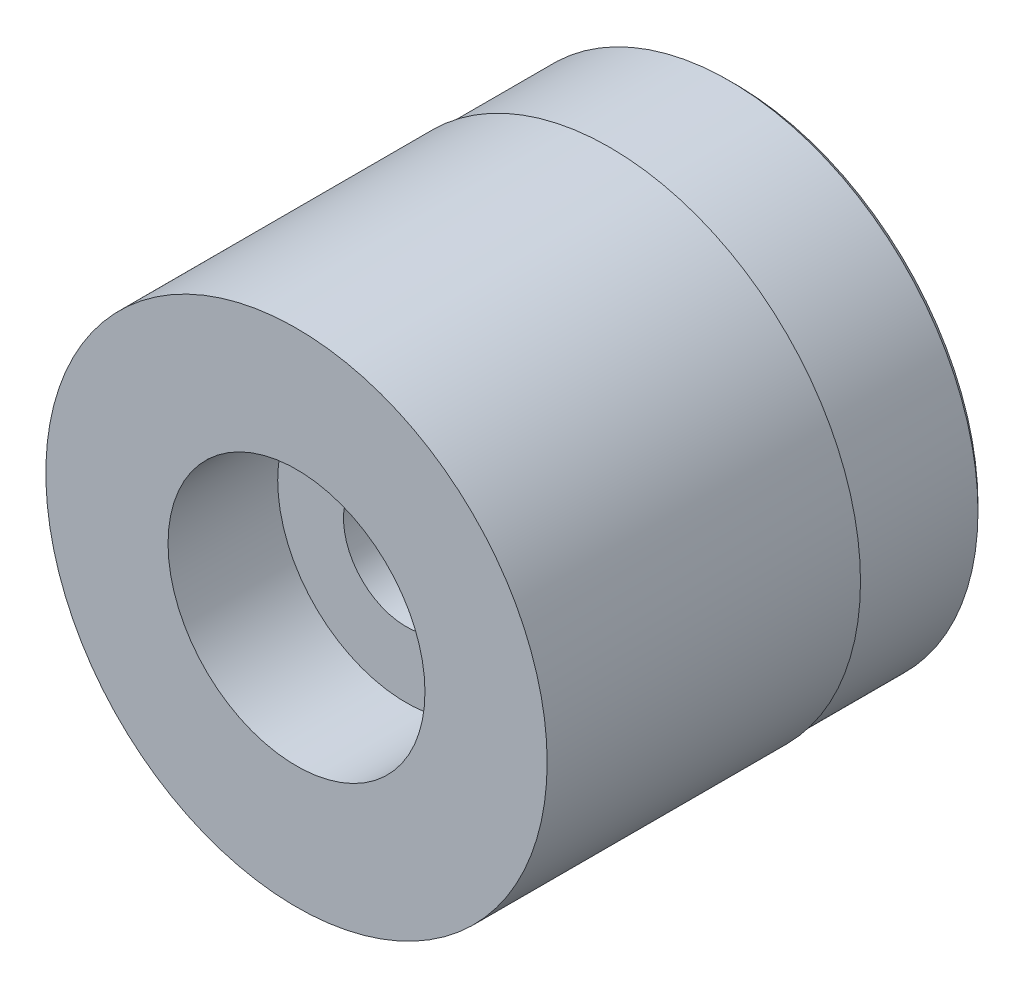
from build123d import *

# Parameters (mm, degrees)
SKETCH4_W = 4
SKETCH4_H = 1


with BuildPart() as part:
    # Sketch1 → Revolve1 (revolve)
    with BuildSketch(Plane(origin=(0, 0, 0), x_dir=(0, 0, -1), z_dir=(1, 0, 0)), mode=Mode.PRIVATE) as revolve1_sk:
        Polygon((0, 8), (0, 4.1), (3.5, 4.1), (3.5, 2), (14, 2), (14, 7.75), (13.75, 8), align=None)
    revolve(revolve1_sk.sketch.rotate(Axis((0, 0, 3.797909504), (0, 0, -1)), 90), axis=Axis((0, 0, 3.797909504), (0, 0, -1)))

    # Sketch4 → Cut-Revolve1 (revolve, cut)
    with BuildSketch(Plane(origin=(0, 0, 0), x_dir=(0, 0, -1), z_dir=(1, 0, 0)), mode=Mode.PRIVATE) as cut_revolve1_sk:
        with Locations((12, 8.435)):
            Rectangle(SKETCH4_W, SKETCH4_H)
    revolve(cut_revolve1_sk.sketch.rotate(Axis((0, 0, 0), (0, 0, -1)), 90), axis=Axis((0, 0, 0), (0, 0, -1)), mode=Mode.SUBTRACT)


solid = part.part
